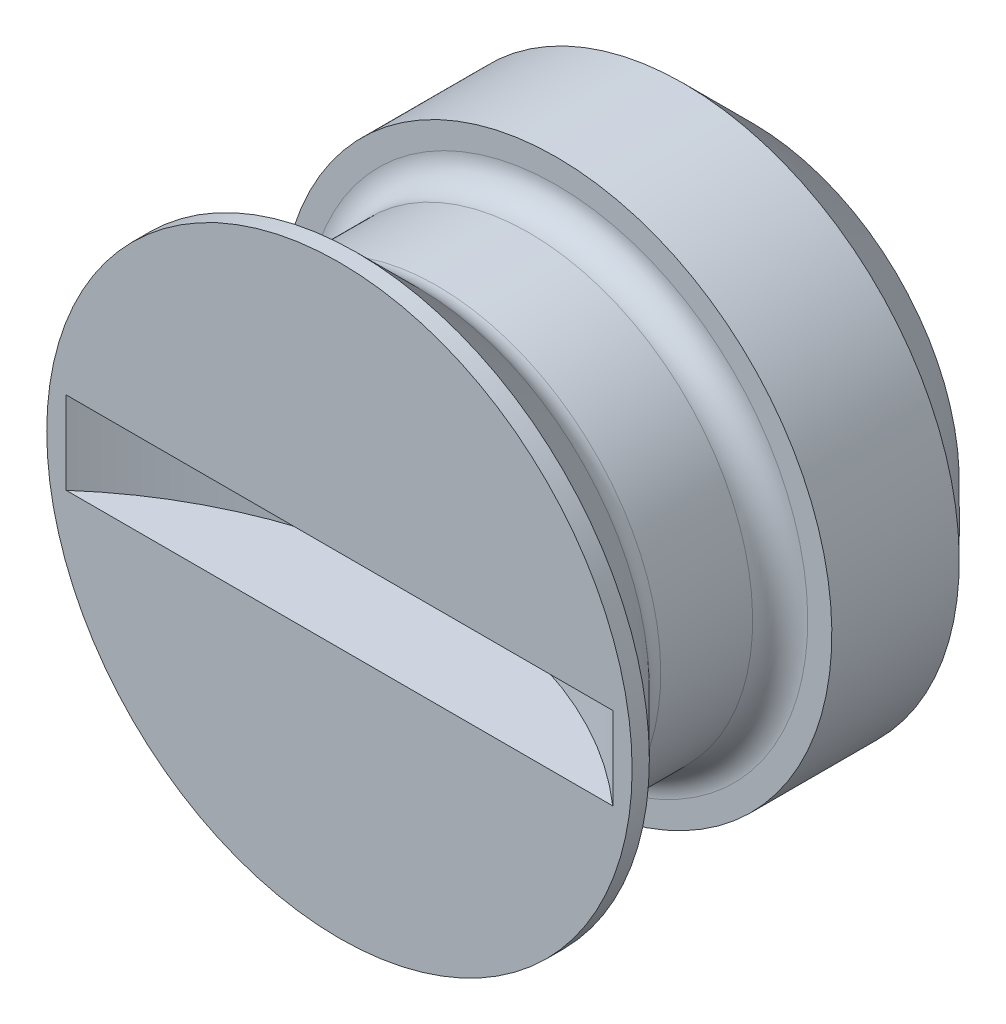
ISO-10303-21;
HEADER;
FILE_DESCRIPTION(('STEP AP214'),'2;1');
FILE_NAME('part.step','',(''),(''),'','','');
FILE_SCHEMA(('AUTOMOTIVE_DESIGN { 1 0 10303 214 1 1 1 1 }'));
ENDSEC;
DATA;
#1=APPLICATION_CONTEXT('core data for automotive mechanical design processes');
#2=APPLICATION_PROTOCOL_DEFINITION('international standard','automotive_design',2000,#1);
#3=PRODUCT_CONTEXT('',#1,'mechanical');
#4=PRODUCT('Part','Part','',(#3));
#5=PRODUCT_RELATED_PRODUCT_CATEGORY('part','',(#4));
#6=PRODUCT_DEFINITION_FORMATION('','',#4);
#7=PRODUCT_DEFINITION_CONTEXT('part definition',#1,'design');
#8=PRODUCT_DEFINITION('design','',#6,#7);
#9=PRODUCT_DEFINITION_SHAPE('','',#8);
#10=(LENGTH_UNIT() NAMED_UNIT(*) SI_UNIT(.MILLI.,.METRE.));
#11=(NAMED_UNIT(*) PLANE_ANGLE_UNIT() SI_UNIT($,.RADIAN.));
#12=(NAMED_UNIT(*) SI_UNIT($,.STERADIAN.) SOLID_ANGLE_UNIT());
#13=UNCERTAINTY_MEASURE_WITH_UNIT(LENGTH_MEASURE(1.E-05),#10,'distance_accuracy_value','');
#14=(GEOMETRIC_REPRESENTATION_CONTEXT(3) GLOBAL_UNCERTAINTY_ASSIGNED_CONTEXT((#13)) GLOBAL_UNIT_ASSIGNED_CONTEXT((#10,
#11,#12)) REPRESENTATION_CONTEXT('',''));
#15=CARTESIAN_POINT('',(0.,0.,0.));
#16=DIRECTION('',(0.,0.,1.));
#17=DIRECTION('',(1.,0.,0.));
#18=AXIS2_PLACEMENT_3D('',#15,#16,#17);
#19=CARTESIAN_POINT('',(0.,0.,0.));
#20=DIRECTION('',(0.,0.,-1.));
#21=DIRECTION('',(0.,-1.,0.));
#22=AXIS2_PLACEMENT_3D('',#19,#20,#21);
#23=PLANE('',#22);
#24=CARTESIAN_POINT('',(0.,0.,0.));
#25=DIRECTION('',(0.,0.,1.));
#26=DIRECTION('',(0.,1.,0.));
#27=AXIS2_PLACEMENT_3D('',#24,#25,#26);
#28=CIRCLE('',#27,4.25);
#29=CARTESIAN_POINT('',(0.,4.25,0.));
#30=VERTEX_POINT('',#29);
#31=EDGE_CURVE('E59',#30,#30,#28,.T.);
#32=ORIENTED_EDGE('',*,*,#31,.T.);
#33=EDGE_LOOP('',(#32));
#34=FACE_BOUND('',#33,.T.);
#35=DIRECTION('',(1.,0.,0.));
#36=VECTOR('',#35,1.);
#37=CARTESIAN_POINT('',(0.,-0.6,0.));
#38=LINE('',#37,#36);
#39=CARTESIAN_POINT('',(-3.96862696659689,-0.6,0.));
#40=VERTEX_POINT('',#39);
#41=CARTESIAN_POINT('',(3.96862696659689,-0.6,0.));
#42=VERTEX_POINT('',#41);
#43=EDGE_CURVE('E9',#40,#42,#38,.T.);
#44=ORIENTED_EDGE('',*,*,#43,.F.);
#45=DIRECTION('',(0.,1.,0.));
#46=VECTOR('',#45,1.);
#47=CARTESIAN_POINT('',(-3.96862696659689,-0.6,0.));
#48=LINE('',#47,#46);
#49=CARTESIAN_POINT('',(-3.96862696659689,0.6,0.));
#50=VERTEX_POINT('',#49);
#51=EDGE_CURVE('E22',#40,#50,#48,.T.);
#52=ORIENTED_EDGE('',*,*,#51,.T.);
#53=DIRECTION('',(1.,0.,0.));
#54=VECTOR('',#53,1.);
#55=CARTESIAN_POINT('',(0.,0.6,0.));
#56=LINE('',#55,#54);
#57=CARTESIAN_POINT('',(3.96862696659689,0.6,0.));
#58=VERTEX_POINT('',#57);
#59=EDGE_CURVE('E40',#50,#58,#56,.T.);
#60=ORIENTED_EDGE('',*,*,#59,.T.);
#61=DIRECTION('',(0.,1.,0.));
#62=VECTOR('',#61,1.);
#63=CARTESIAN_POINT('',(3.96862696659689,-0.6,0.));
#64=LINE('',#63,#62);
#65=EDGE_CURVE('E45',#58,#42,#64,.F.);
#66=ORIENTED_EDGE('',*,*,#65,.T.);
#67=EDGE_LOOP('',(#44,#52,#60,#66));
#68=FACE_BOUND('',#67,.T.);
#69=ADVANCED_FACE('F14',(#34,#68),#23,.F.);
#70=CARTESIAN_POINT('',(0.,0.,-1.4156854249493));
#71=DIRECTION('',(0.,0.,1.));
#72=DIRECTION('',(0.,1.,0.));
#73=AXIS2_PLACEMENT_3D('',#70,#71,#72);
#74=TOROIDAL_SURFACE('',#73,3.64999999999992,0.4);
#75=CARTESIAN_POINT('',(0.,0.,-1.13284271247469));
#76=DIRECTION('',(0.,0.,1.));
#77=DIRECTION('',(0.,1.,0.));
#78=AXIS2_PLACEMENT_3D('',#75,#76,#77);
#79=CIRCLE('',#78,3.36715728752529);
#80=CARTESIAN_POINT('',(0.,3.36715728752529,-1.13284271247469));
#81=VERTEX_POINT('',#80);
#82=EDGE_CURVE('E46',#81,#81,#79,.T.);
#83=ORIENTED_EDGE('',*,*,#82,.F.);
#84=EDGE_LOOP('',(#83));
#85=FACE_BOUND('',#84,.T.);
#86=CARTESIAN_POINT('',(0.,0.,-1.41568542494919));
#87=DIRECTION('',(0.,0.,1.));
#88=DIRECTION('',(0.,1.,0.));
#89=AXIS2_PLACEMENT_3D('',#86,#87,#88);
#90=CIRCLE('',#89,3.24999999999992);
#91=CARTESIAN_POINT('',(0.,3.24999999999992,-1.41568542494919));
#92=VERTEX_POINT('',#91);
#93=EDGE_CURVE('E77',#92,#92,#90,.T.);
#94=ORIENTED_EDGE('',*,*,#93,.T.);
#95=EDGE_LOOP('',(#94));
#96=FACE_BOUND('',#95,.T.);
#97=ADVANCED_FACE('F16',(#85,#96),#74,.F.);
#98=CARTESIAN_POINT('',(0.,0.,-1.13284271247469));
#99=DIRECTION('',(0.,0.,1.));
#100=DIRECTION('',(0.,1.,0.));
#101=AXIS2_PLACEMENT_3D('',#98,#99,#100);
#102=CONICAL_SURFACE('',#101,3.36715728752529,0.785398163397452);
#103=CARTESIAN_POINT('',(0.,0.,-0.25));
#104=DIRECTION('',(0.,0.,1.));
#105=DIRECTION('',(0.,1.,0.));
#106=AXIS2_PLACEMENT_3D('',#103,#104,#105);
#107=CIRCLE('',#106,4.25);
#108=CARTESIAN_POINT('',(0.,4.25,-0.25));
#109=VERTEX_POINT('',#108);
#110=EDGE_CURVE('E56',#109,#109,#107,.T.);
#111=ORIENTED_EDGE('',*,*,#110,.F.);
#112=EDGE_LOOP('',(#111));
#113=FACE_BOUND('',#112,.T.);
#114=ORIENTED_EDGE('',*,*,#82,.T.);
#115=EDGE_LOOP('',(#114));
#116=FACE_BOUND('',#115,.T.);
#117=ADVANCED_FACE('F99',(#113,#116),#102,.T.);
#118=CARTESIAN_POINT('',(0.,0.,0.));
#119=DIRECTION('',(0.,0.,1.));
#120=DIRECTION('',(0.,1.,0.));
#121=AXIS2_PLACEMENT_3D('',#118,#119,#120);
#122=CYLINDRICAL_SURFACE('',#121,4.25);
#123=ORIENTED_EDGE('',*,*,#31,.F.);
#124=EDGE_LOOP('',(#123));
#125=FACE_BOUND('',#124,.T.);
#126=ORIENTED_EDGE('',*,*,#110,.T.);
#127=EDGE_LOOP('',(#126));
#128=FACE_BOUND('',#127,.T.);
#129=ADVANCED_FACE('F105',(#125,#128),#122,.T.);
#130=CARTESIAN_POINT('',(-3.,0.,-5.99999999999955));
#131=DIRECTION('',(0.,0.,1.));
#132=DIRECTION('',(0.,1.,0.));
#133=AXIS2_PLACEMENT_3D('',#130,#131,#132);
#134=PLANE('',#133);
#135=CARTESIAN_POINT('',(0.,0.,-5.99999999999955));
#136=DIRECTION('',(0.,0.,1.));
#137=DIRECTION('',(0.,1.,0.));
#138=AXIS2_PLACEMENT_3D('',#135,#136,#137);
#139=CIRCLE('',#138,3.);
#140=CARTESIAN_POINT('',(0.,3.,-5.99999999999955));
#141=VERTEX_POINT('',#140);
#142=EDGE_CURVE('E62',#141,#141,#139,.T.);
#143=ORIENTED_EDGE('',*,*,#142,.F.);
#144=EDGE_LOOP('',(#143));
#145=FACE_BOUND('',#144,.T.);
#146=ADVANCED_FACE('F103',(#145),#134,.F.);
#147=CARTESIAN_POINT('',(0.,0.,-5.99999999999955));
#148=DIRECTION('',(0.,0.,1.));
#149=DIRECTION('',(0.,1.,0.));
#150=AXIS2_PLACEMENT_3D('',#147,#148,#149);
#151=CONICAL_SURFACE('',#150,3.,0.785398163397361);
#152=CARTESIAN_POINT('',(0.,0.,-4.99999999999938));
#153=DIRECTION('',(0.,0.,1.));
#154=DIRECTION('',(0.,1.,0.));
#155=AXIS2_PLACEMENT_3D('',#152,#153,#154);
#156=CIRCLE('',#155,4.);
#157=CARTESIAN_POINT('',(0.,4.,-4.99999999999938));
#158=VERTEX_POINT('',#157);
#159=EDGE_CURVE('E65',#158,#158,#156,.T.);
#160=ORIENTED_EDGE('',*,*,#159,.F.);
#161=EDGE_LOOP('',(#160));
#162=FACE_BOUND('',#161,.T.);
#163=ORIENTED_EDGE('',*,*,#142,.T.);
#164=EDGE_LOOP('',(#163));
#165=FACE_BOUND('',#164,.T.);
#166=ADVANCED_FACE('F139',(#162,#165),#151,.T.);
#167=CARTESIAN_POINT('',(0.,0.,0.));
#168=DIRECTION('',(0.,0.,1.));
#169=DIRECTION('',(0.,1.,0.));
#170=AXIS2_PLACEMENT_3D('',#167,#168,#169);
#171=CYLINDRICAL_SURFACE('',#170,4.);
#172=CARTESIAN_POINT('',(0.,0.,-3.14999999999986));
#173=DIRECTION('',(0.,0.,1.));
#174=DIRECTION('',(0.,1.,0.));
#175=AXIS2_PLACEMENT_3D('',#172,#173,#174);
#176=CIRCLE('',#175,4.);
#177=CARTESIAN_POINT('',(0.,4.,-3.14999999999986));
#178=VERTEX_POINT('',#177);
#179=EDGE_CURVE('E68',#178,#178,#176,.T.);
#180=ORIENTED_EDGE('',*,*,#179,.F.);
#181=EDGE_LOOP('',(#180));
#182=FACE_BOUND('',#181,.T.);
#183=ORIENTED_EDGE('',*,*,#159,.T.);
#184=EDGE_LOOP('',(#183));
#185=FACE_BOUND('',#184,.T.);
#186=ADVANCED_FACE('F133',(#182,#185),#171,.T.);
#187=CARTESIAN_POINT('',(-3.64999999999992,0.,-3.14999999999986));
#188=DIRECTION('',(0.,0.,-1.));
#189=DIRECTION('',(0.,-1.,0.));
#190=AXIS2_PLACEMENT_3D('',#187,#188,#189);
#191=PLANE('',#190);
#192=CARTESIAN_POINT('',(0.,0.,-3.14999999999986));
#193=DIRECTION('',(0.,0.,1.));
#194=DIRECTION('',(0.,1.,0.));
#195=AXIS2_PLACEMENT_3D('',#192,#193,#194);
#196=CIRCLE('',#195,3.64999999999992);
#197=CARTESIAN_POINT('',(0.,3.64999999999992,-3.14999999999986));
#198=VERTEX_POINT('',#197);
#199=EDGE_CURVE('E71',#198,#198,#196,.T.);
#200=ORIENTED_EDGE('',*,*,#199,.F.);
#201=EDGE_LOOP('',(#200));
#202=FACE_BOUND('',#201,.T.);
#203=ORIENTED_EDGE('',*,*,#179,.T.);
#204=EDGE_LOOP('',(#203));
#205=FACE_BOUND('',#204,.T.);
#206=ADVANCED_FACE('F127',(#202,#205),#191,.F.);
#207=CARTESIAN_POINT('',(0.,0.,-2.74999999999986));
#208=DIRECTION('',(0.,0.,1.));
#209=DIRECTION('',(0.,1.,0.));
#210=AXIS2_PLACEMENT_3D('',#207,#208,#209);
#211=TOROIDAL_SURFACE('',#210,3.64999999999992,0.4);
#212=CARTESIAN_POINT('',(0.,0.,-2.74999999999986));
#213=DIRECTION('',(0.,0.,1.));
#214=DIRECTION('',(0.,1.,0.));
#215=AXIS2_PLACEMENT_3D('',#212,#213,#214);
#216=CIRCLE('',#215,3.24999999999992);
#217=CARTESIAN_POINT('',(0.,3.24999999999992,-2.74999999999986));
#218=VERTEX_POINT('',#217);
#219=EDGE_CURVE('E74',#218,#218,#216,.T.);
#220=ORIENTED_EDGE('',*,*,#219,.F.);
#221=EDGE_LOOP('',(#220));
#222=FACE_BOUND('',#221,.T.);
#223=ORIENTED_EDGE('',*,*,#199,.T.);
#224=EDGE_LOOP('',(#223));
#225=FACE_BOUND('',#224,.T.);
#226=ADVANCED_FACE('F121',(#222,#225),#211,.F.);
#227=CARTESIAN_POINT('',(0.,0.,0.));
#228=DIRECTION('',(0.,0.,1.));
#229=DIRECTION('',(0.,1.,0.));
#230=AXIS2_PLACEMENT_3D('',#227,#228,#229);
#231=CYLINDRICAL_SURFACE('',#230,3.24999999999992);
#232=ORIENTED_EDGE('',*,*,#93,.F.);
#233=EDGE_LOOP('',(#232));
#234=FACE_BOUND('',#233,.T.);
#235=ORIENTED_EDGE('',*,*,#219,.T.);
#236=EDGE_LOOP('',(#235));
#237=FACE_BOUND('',#236,.T.);
#238=ADVANCED_FACE('F90',(#234,#237),#231,.T.);
#239=CARTESIAN_POINT('',(0.,-0.6,4.5));
#240=DIRECTION('',(0.,1.,0.));
#241=DIRECTION('',(0.,0.,-1.));
#242=AXIS2_PLACEMENT_3D('',#239,#240,#241);
#243=CYLINDRICAL_SURFACE('',#242,6.);
#244=CARTESIAN_POINT('',(0.,-0.6,4.5));
#245=DIRECTION('',(0.,1.,0.));
#246=DIRECTION('',(0.,0.,-1.));
#247=AXIS2_PLACEMENT_3D('',#244,#245,#246);
#248=CIRCLE('',#247,6.);
#249=EDGE_CURVE('E50',#42,#40,#248,.T.);
#250=ORIENTED_EDGE('',*,*,#249,.F.);
#251=ORIENTED_EDGE('',*,*,#65,.F.);
#252=CARTESIAN_POINT('',(0.,0.6,4.5));
#253=DIRECTION('',(0.,1.,0.));
#254=DIRECTION('',(0.,0.,-1.));
#255=AXIS2_PLACEMENT_3D('',#252,#253,#254);
#256=CIRCLE('',#255,6.);
#257=EDGE_CURVE('E28',#58,#50,#256,.T.);
#258=ORIENTED_EDGE('',*,*,#257,.T.);
#259=ORIENTED_EDGE('',*,*,#51,.F.);
#260=EDGE_LOOP('',(#250,#251,#258,#259));
#261=FACE_BOUND('',#260,.T.);
#262=ADVANCED_FACE('F49',(#261),#243,.F.);
#263=CARTESIAN_POINT('',(0.,-0.6,4.5));
#264=DIRECTION('',(0.,1.,0.));
#265=DIRECTION('',(0.,0.,-1.));
#266=AXIS2_PLACEMENT_3D('',#263,#264,#265);
#267=PLANE('',#266);
#268=ORIENTED_EDGE('',*,*,#43,.T.);
#269=ORIENTED_EDGE('',*,*,#249,.T.);
#270=EDGE_LOOP('',(#268,#269));
#271=FACE_BOUND('',#270,.T.);
#272=ADVANCED_FACE('F80',(#271),#267,.T.);
#273=CARTESIAN_POINT('',(0.,0.6,4.5));
#274=DIRECTION('',(0.,1.,0.));
#275=DIRECTION('',(0.,0.,-1.));
#276=AXIS2_PLACEMENT_3D('',#273,#274,#275);
#277=PLANE('',#276);
#278=ORIENTED_EDGE('',*,*,#257,.F.);
#279=ORIENTED_EDGE('',*,*,#59,.F.);
#280=EDGE_LOOP('',(#278,#279));
#281=FACE_BOUND('',#280,.T.);
#282=ADVANCED_FACE('F41',(#281),#277,.F.);
#283=CLOSED_SHELL('',(#69,#97,#117,#129,#146,#166,#186,#206,#226,#238,#262,#272,#282));
#284=MANIFOLD_SOLID_BREP('B1',#283);
#285=ADVANCED_BREP_SHAPE_REPRESENTATION('',(#18,#284),#14);
#286=SHAPE_DEFINITION_REPRESENTATION(#9,#285);
ENDSEC;
END-ISO-10303-21;
